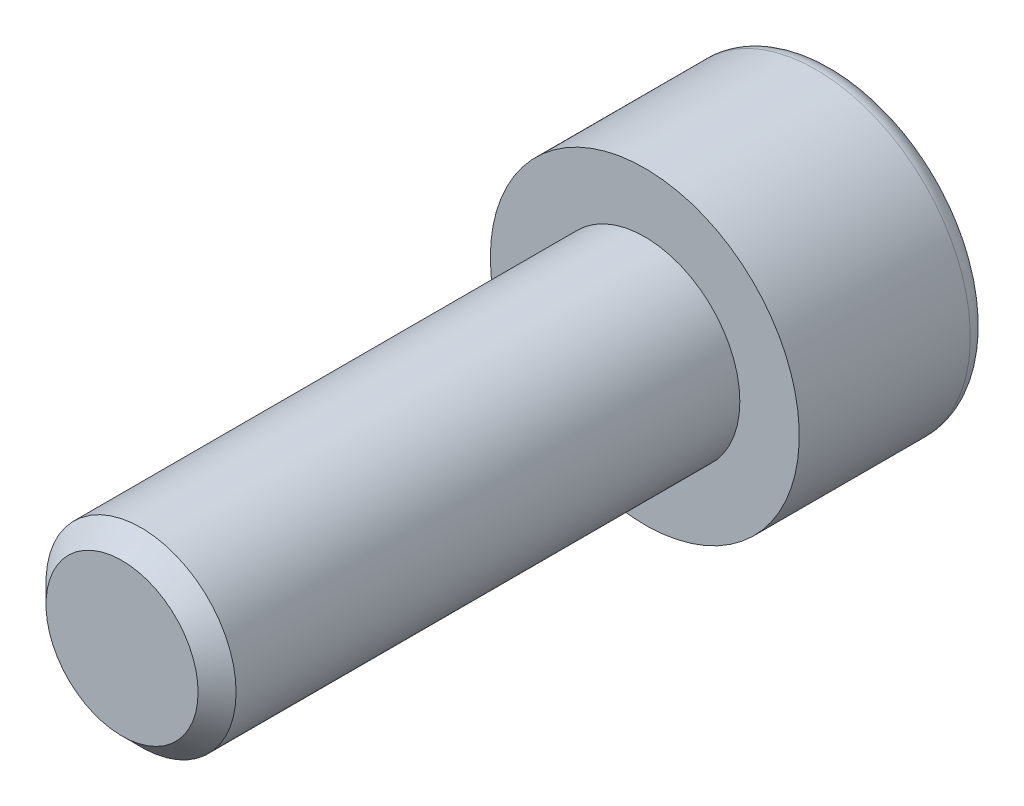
ISO-10303-21;
HEADER;
FILE_DESCRIPTION(('STEP AP214'),'2;1');
FILE_NAME('part.step','',(''),(''),'','','');
FILE_SCHEMA(('AUTOMOTIVE_DESIGN { 1 0 10303 214 1 1 1 1 }'));
ENDSEC;
DATA;
#1=APPLICATION_CONTEXT('core data for automotive mechanical design processes');
#2=APPLICATION_PROTOCOL_DEFINITION('international standard','automotive_design',2000,#1);
#3=PRODUCT_CONTEXT('',#1,'mechanical');
#4=PRODUCT('Part','Part','',(#3));
#5=PRODUCT_RELATED_PRODUCT_CATEGORY('part','',(#4));
#6=PRODUCT_DEFINITION_FORMATION('','',#4);
#7=PRODUCT_DEFINITION_CONTEXT('part definition',#1,'design');
#8=PRODUCT_DEFINITION('design','',#6,#7);
#9=PRODUCT_DEFINITION_SHAPE('','',#8);
#10=(LENGTH_UNIT() NAMED_UNIT(*) SI_UNIT(.MILLI.,.METRE.));
#11=(NAMED_UNIT(*) PLANE_ANGLE_UNIT() SI_UNIT($,.RADIAN.));
#12=(NAMED_UNIT(*) SI_UNIT($,.STERADIAN.) SOLID_ANGLE_UNIT());
#13=UNCERTAINTY_MEASURE_WITH_UNIT(LENGTH_MEASURE(1.E-05),#10,'distance_accuracy_value','');
#14=(GEOMETRIC_REPRESENTATION_CONTEXT(3) GLOBAL_UNCERTAINTY_ASSIGNED_CONTEXT((#13)) GLOBAL_UNIT_ASSIGNED_CONTEXT((#10,
#11,#12)) REPRESENTATION_CONTEXT('',''));
#15=CARTESIAN_POINT('',(0.,0.,0.));
#16=DIRECTION('',(0.,0.,1.));
#17=DIRECTION('',(1.,0.,0.));
#18=AXIS2_PLACEMENT_3D('',#15,#16,#17);
#19=CARTESIAN_POINT('',(0.,0.,-8.));
#20=DIRECTION('',(0.,0.,1.));
#21=DIRECTION('',(1.,0.,0.));
#22=AXIS2_PLACEMENT_3D('',#19,#20,#21);
#23=PLANE('',#22);
#24=CARTESIAN_POINT('',(0.,0.,-8.));
#25=DIRECTION('',(0.,0.,-1.));
#26=DIRECTION('',(-1.,0.,0.));
#27=AXIS2_PLACEMENT_3D('',#24,#25,#26);
#28=CIRCLE('',#27,5.7);
#29=CARTESIAN_POINT('',(-5.7,0.,-8.));
#30=VERTEX_POINT('',#29);
#31=EDGE_CURVE('E141',#30,#30,#28,.T.);
#32=ORIENTED_EDGE('',*,*,#31,.T.);
#33=EDGE_LOOP('',(#32));
#34=FACE_BOUND('',#33,.T.);
#35=DIRECTION('',(-0.86602540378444,0.499999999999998,0.));
#36=VECTOR('',#35,1.);
#37=CARTESIAN_POINT('',(0.,3.46410161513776,-8.));
#38=LINE('',#37,#36);
#39=CARTESIAN_POINT('',(3.,1.73205080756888,-8.));
#40=VERTEX_POINT('',#39);
#41=CARTESIAN_POINT('',(0.,3.46410161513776,-8.));
#42=VERTEX_POINT('',#41);
#43=EDGE_CURVE('E45',#40,#42,#38,.T.);
#44=ORIENTED_EDGE('',*,*,#43,.T.);
#45=DIRECTION('',(-0.866025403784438,-0.500000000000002,0.));
#46=VECTOR('',#45,1.);
#47=CARTESIAN_POINT('',(0.,3.46410161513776,-8.));
#48=LINE('',#47,#46);
#49=CARTESIAN_POINT('',(-3.,1.73205080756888,-8.));
#50=VERTEX_POINT('',#49);
#51=EDGE_CURVE('E85',#42,#50,#48,.T.);
#52=ORIENTED_EDGE('',*,*,#51,.T.);
#53=DIRECTION('',(0.,-1.,0.));
#54=VECTOR('',#53,1.);
#55=CARTESIAN_POINT('',(-3.,-1.73205080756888,-8.));
#56=LINE('',#55,#54);
#57=CARTESIAN_POINT('',(-3.,-1.73205080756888,-8.));
#58=VERTEX_POINT('',#57);
#59=EDGE_CURVE('E93',#50,#58,#56,.T.);
#60=ORIENTED_EDGE('',*,*,#59,.T.);
#61=DIRECTION('',(0.866025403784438,-0.500000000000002,0.));
#62=VECTOR('',#61,1.);
#63=CARTESIAN_POINT('',(0.,-3.46410161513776,-8.));
#64=LINE('',#63,#62);
#65=CARTESIAN_POINT('',(0.,-3.46410161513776,-8.));
#66=VERTEX_POINT('',#65);
#67=EDGE_CURVE('E111',#58,#66,#64,.T.);
#68=ORIENTED_EDGE('',*,*,#67,.T.);
#69=DIRECTION('',(0.86602540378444,0.499999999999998,0.));
#70=VECTOR('',#69,1.);
#71=CARTESIAN_POINT('',(0.,-3.46410161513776,-8.));
#72=LINE('',#71,#70);
#73=CARTESIAN_POINT('',(3.,-1.73205080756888,-8.));
#74=VERTEX_POINT('',#73);
#75=EDGE_CURVE('E114',#66,#74,#72,.T.);
#76=ORIENTED_EDGE('',*,*,#75,.T.);
#77=DIRECTION('',(0.,1.,0.));
#78=VECTOR('',#77,1.);
#79=CARTESIAN_POINT('',(3.,-1.73205080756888,-8.));
#80=LINE('',#79,#78);
#81=EDGE_CURVE('E104',#74,#40,#80,.T.);
#82=ORIENTED_EDGE('',*,*,#81,.T.);
#83=EDGE_LOOP('',(#44,#52,#60,#68,#76,#82));
#84=FACE_BOUND('',#83,.T.);
#85=ADVANCED_FACE('F31',(#34,#84),#23,.F.);
#86=CARTESIAN_POINT('',(0.,0.,-7.2));
#87=DIRECTION('',(0.,0.,-1.));
#88=DIRECTION('',(-1.,0.,0.));
#89=AXIS2_PLACEMENT_3D('',#86,#87,#88);
#90=TOROIDAL_SURFACE('',#89,5.7,0.8);
#91=ORIENTED_EDGE('',*,*,#31,.F.);
#92=EDGE_LOOP('',(#91));
#93=FACE_BOUND('',#92,.T.);
#94=CARTESIAN_POINT('',(0.,0.,-7.2));
#95=DIRECTION('',(0.,0.,-1.));
#96=DIRECTION('',(-1.,0.,0.));
#97=AXIS2_PLACEMENT_3D('',#94,#95,#96);
#98=CIRCLE('',#97,6.5);
#99=CARTESIAN_POINT('',(-6.5,0.,-7.2));
#100=VERTEX_POINT('',#99);
#101=EDGE_CURVE('E138',#100,#100,#98,.T.);
#102=ORIENTED_EDGE('',*,*,#101,.T.);
#103=EDGE_LOOP('',(#102));
#104=FACE_BOUND('',#103,.T.);
#105=ADVANCED_FACE('F160',(#93,#104),#90,.T.);
#106=CARTESIAN_POINT('',(0.,0.,0.));
#107=DIRECTION('',(0.,0.,-1.));
#108=DIRECTION('',(-1.,0.,0.));
#109=AXIS2_PLACEMENT_3D('',#106,#107,#108);
#110=CYLINDRICAL_SURFACE('',#109,6.5);
#111=ORIENTED_EDGE('',*,*,#101,.F.);
#112=EDGE_LOOP('',(#111));
#113=FACE_BOUND('',#112,.T.);
#114=CARTESIAN_POINT('',(0.,0.,0.));
#115=DIRECTION('',(0.,0.,-1.));
#116=DIRECTION('',(-1.,0.,0.));
#117=AXIS2_PLACEMENT_3D('',#114,#115,#116);
#118=CIRCLE('',#117,6.5);
#119=CARTESIAN_POINT('',(-6.5,0.,0.));
#120=VERTEX_POINT('',#119);
#121=EDGE_CURVE('E99',#120,#120,#118,.T.);
#122=ORIENTED_EDGE('',*,*,#121,.T.);
#123=EDGE_LOOP('',(#122));
#124=FACE_BOUND('',#123,.T.);
#125=ADVANCED_FACE('F165',(#113,#124),#110,.T.);
#126=CARTESIAN_POINT('',(0.,0.,0.));
#127=DIRECTION('',(0.,0.,-1.));
#128=DIRECTION('',(-1.,0.,0.));
#129=AXIS2_PLACEMENT_3D('',#126,#127,#128);
#130=PLANE('',#129);
#131=CARTESIAN_POINT('',(0.,0.,0.));
#132=DIRECTION('',(0.,0.,1.));
#133=DIRECTION('',(1.,0.,0.));
#134=AXIS2_PLACEMENT_3D('',#131,#132,#133);
#135=CIRCLE('',#134,4.);
#136=CARTESIAN_POINT('',(4.,0.,0.));
#137=VERTEX_POINT('',#136);
#138=EDGE_CURVE('E105',#137,#137,#135,.T.);
#139=ORIENTED_EDGE('',*,*,#138,.F.);
#140=EDGE_LOOP('',(#139));
#141=FACE_BOUND('',#140,.T.);
#142=ORIENTED_EDGE('',*,*,#121,.F.);
#143=EDGE_LOOP('',(#142));
#144=FACE_BOUND('',#143,.T.);
#145=ADVANCED_FACE('F173',(#141,#144),#130,.F.);
#146=CARTESIAN_POINT('',(0.,3.46410161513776,-4.));
#147=DIRECTION('',(-0.499999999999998,-0.86602540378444,0.));
#148=DIRECTION('',(0.86602540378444,-0.499999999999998,0.));
#149=AXIS2_PLACEMENT_3D('',#146,#147,#148);
#150=PLANE('',#149);
#151=ORIENTED_EDGE('',*,*,#43,.F.);
#152=DIRECTION('',(0.,0.,-1.));
#153=VECTOR('',#152,1.);
#154=CARTESIAN_POINT('',(3.,1.73205080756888,-4.));
#155=LINE('',#154,#153);
#156=CARTESIAN_POINT('',(3.,1.73205080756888,-4.));
#157=VERTEX_POINT('',#156);
#158=EDGE_CURVE('E127',#157,#40,#155,.T.);
#159=ORIENTED_EDGE('',*,*,#158,.F.);
#160=DIRECTION('',(-0.86602540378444,0.499999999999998,0.));
#161=VECTOR('',#160,1.);
#162=CARTESIAN_POINT('',(0.,3.46410161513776,-4.));
#163=LINE('',#162,#161);
#164=CARTESIAN_POINT('',(0.,3.46410161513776,-4.));
#165=VERTEX_POINT('',#164);
#166=EDGE_CURVE('E98',#157,#165,#163,.T.);
#167=ORIENTED_EDGE('',*,*,#166,.T.);
#168=DIRECTION('',(0.,0.,-1.));
#169=VECTOR('',#168,1.);
#170=CARTESIAN_POINT('',(0.,3.46410161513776,-4.));
#171=LINE('',#170,#169);
#172=EDGE_CURVE('E87',#165,#42,#171,.T.);
#173=ORIENTED_EDGE('',*,*,#172,.T.);
#174=EDGE_LOOP('',(#151,#159,#167,#173));
#175=FACE_BOUND('',#174,.T.);
#176=ADVANCED_FACE('F96',(#175),#150,.T.);
#177=CARTESIAN_POINT('',(0.,3.46410161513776,-4.));
#178=DIRECTION('',(0.500000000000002,-0.866025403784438,0.));
#179=DIRECTION('',(0.866025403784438,0.500000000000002,0.));
#180=AXIS2_PLACEMENT_3D('',#177,#178,#179);
#181=PLANE('',#180);
#182=ORIENTED_EDGE('',*,*,#51,.F.);
#183=ORIENTED_EDGE('',*,*,#172,.F.);
#184=DIRECTION('',(-0.866025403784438,-0.500000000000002,0.));
#185=VECTOR('',#184,1.);
#186=CARTESIAN_POINT('',(0.,3.46410161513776,-4.));
#187=LINE('',#186,#185);
#188=CARTESIAN_POINT('',(-3.,1.73205080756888,-4.));
#189=VERTEX_POINT('',#188);
#190=EDGE_CURVE('E118',#165,#189,#187,.T.);
#191=ORIENTED_EDGE('',*,*,#190,.T.);
#192=DIRECTION('',(0.,0.,-1.));
#193=VECTOR('',#192,1.);
#194=CARTESIAN_POINT('',(-3.,1.73205080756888,-4.));
#195=LINE('',#194,#193);
#196=EDGE_CURVE('E89',#189,#50,#195,.T.);
#197=ORIENTED_EDGE('',*,*,#196,.T.);
#198=EDGE_LOOP('',(#182,#183,#191,#197));
#199=FACE_BOUND('',#198,.T.);
#200=ADVANCED_FACE('F86',(#199),#181,.T.);
#201=CARTESIAN_POINT('',(-3.,-1.73205080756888,-4.));
#202=DIRECTION('',(1.,0.,0.));
#203=DIRECTION('',(0.,0.,-1.));
#204=AXIS2_PLACEMENT_3D('',#201,#202,#203);
#205=PLANE('',#204);
#206=ORIENTED_EDGE('',*,*,#59,.F.);
#207=ORIENTED_EDGE('',*,*,#196,.F.);
#208=DIRECTION('',(0.,-1.,0.));
#209=VECTOR('',#208,1.);
#210=CARTESIAN_POINT('',(-3.,-1.73205080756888,-4.));
#211=LINE('',#210,#209);
#212=CARTESIAN_POINT('',(-3.,-1.73205080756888,-4.));
#213=VERTEX_POINT('',#212);
#214=EDGE_CURVE('E120',#189,#213,#211,.T.);
#215=ORIENTED_EDGE('',*,*,#214,.T.);
#216=DIRECTION('',(0.,0.,-1.));
#217=VECTOR('',#216,1.);
#218=CARTESIAN_POINT('',(-3.,-1.73205080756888,-4.));
#219=LINE('',#218,#217);
#220=EDGE_CURVE('E133',#213,#58,#219,.T.);
#221=ORIENTED_EDGE('',*,*,#220,.T.);
#222=EDGE_LOOP('',(#206,#207,#215,#221));
#223=FACE_BOUND('',#222,.T.);
#224=ADVANCED_FACE('F188',(#223),#205,.T.);
#225=CARTESIAN_POINT('',(0.,-3.46410161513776,-4.));
#226=DIRECTION('',(0.500000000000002,0.866025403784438,0.));
#227=DIRECTION('',(-0.866025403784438,0.500000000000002,0.));
#228=AXIS2_PLACEMENT_3D('',#225,#226,#227);
#229=PLANE('',#228);
#230=ORIENTED_EDGE('',*,*,#67,.F.);
#231=ORIENTED_EDGE('',*,*,#220,.F.);
#232=DIRECTION('',(0.866025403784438,-0.500000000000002,0.));
#233=VECTOR('',#232,1.);
#234=CARTESIAN_POINT('',(0.,-3.46410161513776,-4.));
#235=LINE('',#234,#233);
#236=CARTESIAN_POINT('',(0.,-3.46410161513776,-4.));
#237=VERTEX_POINT('',#236);
#238=EDGE_CURVE('E122',#213,#237,#235,.T.);
#239=ORIENTED_EDGE('',*,*,#238,.T.);
#240=DIRECTION('',(0.,0.,-1.));
#241=VECTOR('',#240,1.);
#242=CARTESIAN_POINT('',(0.,-3.46410161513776,-4.));
#243=LINE('',#242,#241);
#244=EDGE_CURVE('E131',#237,#66,#243,.T.);
#245=ORIENTED_EDGE('',*,*,#244,.T.);
#246=EDGE_LOOP('',(#230,#231,#239,#245));
#247=FACE_BOUND('',#246,.T.);
#248=ADVANCED_FACE('F191',(#247),#229,.T.);
#249=CARTESIAN_POINT('',(0.,-3.46410161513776,-4.));
#250=DIRECTION('',(-0.499999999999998,0.86602540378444,0.));
#251=DIRECTION('',(-0.86602540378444,-0.499999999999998,0.));
#252=AXIS2_PLACEMENT_3D('',#249,#250,#251);
#253=PLANE('',#252);
#254=ORIENTED_EDGE('',*,*,#75,.F.);
#255=ORIENTED_EDGE('',*,*,#244,.F.);
#256=DIRECTION('',(0.86602540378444,0.499999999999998,0.));
#257=VECTOR('',#256,1.);
#258=CARTESIAN_POINT('',(0.,-3.46410161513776,-4.));
#259=LINE('',#258,#257);
#260=CARTESIAN_POINT('',(3.,-1.73205080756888,-4.));
#261=VERTEX_POINT('',#260);
#262=EDGE_CURVE('E124',#237,#261,#259,.T.);
#263=ORIENTED_EDGE('',*,*,#262,.T.);
#264=DIRECTION('',(0.,0.,-1.));
#265=VECTOR('',#264,1.);
#266=CARTESIAN_POINT('',(3.,-1.73205080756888,-4.));
#267=LINE('',#266,#265);
#268=EDGE_CURVE('E129',#261,#74,#267,.T.);
#269=ORIENTED_EDGE('',*,*,#268,.T.);
#270=EDGE_LOOP('',(#254,#255,#263,#269));
#271=FACE_BOUND('',#270,.T.);
#272=ADVANCED_FACE('F195',(#271),#253,.T.);
#273=CARTESIAN_POINT('',(3.,-1.73205080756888,-4.));
#274=DIRECTION('',(-1.,0.,0.));
#275=DIRECTION('',(0.,0.,1.));
#276=AXIS2_PLACEMENT_3D('',#273,#274,#275);
#277=PLANE('',#276);
#278=ORIENTED_EDGE('',*,*,#81,.F.);
#279=ORIENTED_EDGE('',*,*,#268,.F.);
#280=DIRECTION('',(0.,1.,0.));
#281=VECTOR('',#280,1.);
#282=CARTESIAN_POINT('',(3.,-1.73205080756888,-4.));
#283=LINE('',#282,#281);
#284=EDGE_CURVE('E52',#261,#157,#283,.T.);
#285=ORIENTED_EDGE('',*,*,#284,.T.);
#286=ORIENTED_EDGE('',*,*,#158,.T.);
#287=EDGE_LOOP('',(#278,#279,#285,#286));
#288=FACE_BOUND('',#287,.T.);
#289=ADVANCED_FACE('F199',(#288),#277,.T.);
#290=CARTESIAN_POINT('',(3.,1.73205080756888,-4.));
#291=DIRECTION('',(0.,0.,1.));
#292=DIRECTION('',(1.,0.,0.));
#293=AXIS2_PLACEMENT_3D('',#290,#291,#292);
#294=PLANE('',#293);
#295=ORIENTED_EDGE('',*,*,#166,.F.);
#296=ORIENTED_EDGE('',*,*,#284,.F.);
#297=ORIENTED_EDGE('',*,*,#262,.F.);
#298=ORIENTED_EDGE('',*,*,#238,.F.);
#299=ORIENTED_EDGE('',*,*,#214,.F.);
#300=ORIENTED_EDGE('',*,*,#190,.F.);
#301=EDGE_LOOP('',(#295,#296,#297,#298,#299,#300));
#302=FACE_BOUND('',#301,.T.);
#303=ADVANCED_FACE('F203',(#302),#294,.F.);
#304=CARTESIAN_POINT('',(0.,0.,22.));
#305=DIRECTION('',(0.,0.,1.));
#306=DIRECTION('',(1.,0.,0.));
#307=AXIS2_PLACEMENT_3D('',#304,#305,#306);
#308=PLANE('',#307);
#309=CARTESIAN_POINT('',(0.,0.,22.));
#310=DIRECTION('',(0.,0.,1.));
#311=DIRECTION('',(1.,0.,0.));
#312=AXIS2_PLACEMENT_3D('',#309,#310,#311);
#313=CIRCLE('',#312,3.2);
#314=CARTESIAN_POINT('',(3.2,0.,22.));
#315=VERTEX_POINT('',#314);
#316=EDGE_CURVE('E38',#315,#315,#313,.T.);
#317=ORIENTED_EDGE('',*,*,#316,.T.);
#318=EDGE_LOOP('',(#317));
#319=FACE_BOUND('',#318,.T.);
#320=ADVANCED_FACE('F146',(#319),#308,.T.);
#321=CARTESIAN_POINT('',(0.,0.,0.));
#322=DIRECTION('',(0.,0.,1.));
#323=DIRECTION('',(1.,0.,0.));
#324=AXIS2_PLACEMENT_3D('',#321,#322,#323);
#325=CYLINDRICAL_SURFACE('',#324,4.);
#326=CARTESIAN_POINT('',(0.,0.,21.2));
#327=DIRECTION('',(0.,0.,1.));
#328=DIRECTION('',(1.,0.,0.));
#329=AXIS2_PLACEMENT_3D('',#326,#327,#328);
#330=CIRCLE('',#329,4.);
#331=CARTESIAN_POINT('',(4.,0.,21.2));
#332=VERTEX_POINT('',#331);
#333=EDGE_CURVE('E11',#332,#332,#330,.F.);
#334=ORIENTED_EDGE('',*,*,#333,.T.);
#335=EDGE_LOOP('',(#334));
#336=FACE_BOUND('',#335,.T.);
#337=ORIENTED_EDGE('',*,*,#138,.T.);
#338=EDGE_LOOP('',(#337));
#339=FACE_BOUND('',#338,.T.);
#340=ADVANCED_FACE('F150',(#336,#339),#325,.T.);
#341=CARTESIAN_POINT('',(0.,0.,22.));
#342=DIRECTION('',(0.,0.,-1.));
#343=DIRECTION('',(-1.,0.,0.));
#344=AXIS2_PLACEMENT_3D('',#341,#342,#343);
#345=CONICAL_SURFACE('',#344,3.2,0.785398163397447);
#346=ORIENTED_EDGE('',*,*,#333,.F.);
#347=EDGE_LOOP('',(#346));
#348=FACE_BOUND('',#347,.T.);
#349=ORIENTED_EDGE('',*,*,#316,.F.);
#350=EDGE_LOOP('',(#349));
#351=FACE_BOUND('',#350,.T.);
#352=ADVANCED_FACE('F148',(#348,#351),#345,.T.);
#353=CLOSED_SHELL('',(#85,#105,#125,#145,#176,#200,#224,#248,#272,#289,#303,#320,#340,#352));
#354=MANIFOLD_SOLID_BREP('B2',#353);
#355=ADVANCED_BREP_SHAPE_REPRESENTATION('',(#18,#354),#14);
#356=SHAPE_DEFINITION_REPRESENTATION(#9,#355);
ENDSEC;
END-ISO-10303-21;
